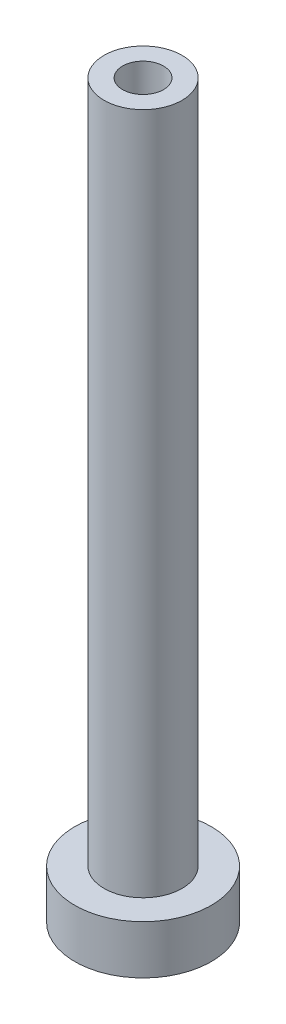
ISO-10303-21;
HEADER;
FILE_DESCRIPTION(('STEP AP214'),'2;1');
FILE_NAME('part.step','',(''),(''),'','','');
FILE_SCHEMA(('AUTOMOTIVE_DESIGN { 1 0 10303 214 1 1 1 1 }'));
ENDSEC;
DATA;
#1=APPLICATION_CONTEXT('core data for automotive mechanical design processes');
#2=APPLICATION_PROTOCOL_DEFINITION('international standard','automotive_design',2000,#1);
#3=PRODUCT_CONTEXT('',#1,'mechanical');
#4=PRODUCT('Part','Part','',(#3));
#5=PRODUCT_RELATED_PRODUCT_CATEGORY('part','',(#4));
#6=PRODUCT_DEFINITION_FORMATION('','',#4);
#7=PRODUCT_DEFINITION_CONTEXT('part definition',#1,'design');
#8=PRODUCT_DEFINITION('design','',#6,#7);
#9=PRODUCT_DEFINITION_SHAPE('','',#8);
#10=(LENGTH_UNIT() NAMED_UNIT(*) SI_UNIT(.MILLI.,.METRE.));
#11=(NAMED_UNIT(*) PLANE_ANGLE_UNIT() SI_UNIT($,.RADIAN.));
#12=(NAMED_UNIT(*) SI_UNIT($,.STERADIAN.) SOLID_ANGLE_UNIT());
#13=UNCERTAINTY_MEASURE_WITH_UNIT(LENGTH_MEASURE(1.E-05),#10,'distance_accuracy_value','');
#14=(GEOMETRIC_REPRESENTATION_CONTEXT(3) GLOBAL_UNCERTAINTY_ASSIGNED_CONTEXT((#13)) GLOBAL_UNIT_ASSIGNED_CONTEXT((#10,
#11,#12)) REPRESENTATION_CONTEXT('',''));
#15=CARTESIAN_POINT('',(0.,0.,0.));
#16=DIRECTION('',(0.,0.,1.));
#17=DIRECTION('',(1.,0.,0.));
#18=AXIS2_PLACEMENT_3D('',#15,#16,#17);
#19=CARTESIAN_POINT('',(0.,0.,0.));
#20=DIRECTION('',(0.,-1.,0.));
#21=DIRECTION('',(0.,0.,-1.));
#22=AXIS2_PLACEMENT_3D('',#19,#20,#21);
#23=CYLINDRICAL_SURFACE('',#22,7.);
#24=CARTESIAN_POINT('',(0.,-5.,0.));
#25=DIRECTION('',(0.,-1.,0.));
#26=DIRECTION('',(0.,0.,-1.));
#27=AXIS2_PLACEMENT_3D('',#24,#25,#26);
#28=CIRCLE('',#27,7.);
#29=CARTESIAN_POINT('',(0.,-5.,-7.));
#30=VERTEX_POINT('',#29);
#31=EDGE_CURVE('E42',#30,#30,#28,.T.);
#32=ORIENTED_EDGE('',*,*,#31,.F.);
#33=EDGE_LOOP('',(#32));
#34=FACE_BOUND('',#33,.T.);
#35=CARTESIAN_POINT('',(0.,0.,0.));
#36=DIRECTION('',(0.,-1.,0.));
#37=DIRECTION('',(0.,0.,-1.));
#38=AXIS2_PLACEMENT_3D('',#35,#36,#37);
#39=CIRCLE('',#38,7.);
#40=CARTESIAN_POINT('',(0.,0.,-7.));
#41=VERTEX_POINT('',#40);
#42=EDGE_CURVE('E9',#41,#41,#39,.T.);
#43=ORIENTED_EDGE('',*,*,#42,.T.);
#44=EDGE_LOOP('',(#43));
#45=FACE_BOUND('',#44,.T.);
#46=ADVANCED_FACE('F14',(#34,#45),#23,.T.);
#47=CARTESIAN_POINT('',(-7.,0.,0.));
#48=DIRECTION('',(0.,-1.,0.));
#49=DIRECTION('',(0.,0.,-1.));
#50=AXIS2_PLACEMENT_3D('',#47,#48,#49);
#51=PLANE('',#50);
#52=ORIENTED_EDGE('',*,*,#42,.F.);
#53=EDGE_LOOP('',(#52));
#54=FACE_BOUND('',#53,.T.);
#55=CARTESIAN_POINT('',(0.,0.,0.));
#56=DIRECTION('',(0.,-1.,0.));
#57=DIRECTION('',(0.,0.,-1.));
#58=AXIS2_PLACEMENT_3D('',#55,#56,#57);
#59=CIRCLE('',#58,4.);
#60=CARTESIAN_POINT('',(0.,0.,-4.));
#61=VERTEX_POINT('',#60);
#62=EDGE_CURVE('E20',#61,#61,#59,.T.);
#63=ORIENTED_EDGE('',*,*,#62,.T.);
#64=EDGE_LOOP('',(#63));
#65=FACE_BOUND('',#64,.T.);
#66=ADVANCED_FACE('F49',(#54,#65),#51,.F.);
#67=CARTESIAN_POINT('',(0.,0.,0.));
#68=DIRECTION('',(0.,-1.,0.));
#69=DIRECTION('',(0.,0.,-1.));
#70=AXIS2_PLACEMENT_3D('',#67,#68,#69);
#71=CYLINDRICAL_SURFACE('',#70,4.);
#72=ORIENTED_EDGE('',*,*,#62,.F.);
#73=EDGE_LOOP('',(#72));
#74=FACE_BOUND('',#73,.T.);
#75=CARTESIAN_POINT('',(0.,70.,0.));
#76=DIRECTION('',(0.,-1.,0.));
#77=DIRECTION('',(0.,0.,-1.));
#78=AXIS2_PLACEMENT_3D('',#75,#76,#77);
#79=CIRCLE('',#78,4.);
#80=CARTESIAN_POINT('',(0.,70.,-4.));
#81=VERTEX_POINT('',#80);
#82=EDGE_CURVE('E24',#81,#81,#79,.T.);
#83=ORIENTED_EDGE('',*,*,#82,.T.);
#84=EDGE_LOOP('',(#83));
#85=FACE_BOUND('',#84,.T.);
#86=ADVANCED_FACE('F55',(#74,#85),#71,.T.);
#87=CARTESIAN_POINT('',(-4.,70.,0.));
#88=DIRECTION('',(0.,-1.,0.));
#89=DIRECTION('',(0.,0.,-1.));
#90=AXIS2_PLACEMENT_3D('',#87,#88,#89);
#91=PLANE('',#90);
#92=ORIENTED_EDGE('',*,*,#82,.F.);
#93=EDGE_LOOP('',(#92));
#94=FACE_BOUND('',#93,.T.);
#95=CARTESIAN_POINT('',(0.,70.,0.));
#96=DIRECTION('',(0.,-1.,0.));
#97=DIRECTION('',(0.,0.,-1.));
#98=AXIS2_PLACEMENT_3D('',#95,#96,#97);
#99=CIRCLE('',#98,2.1);
#100=CARTESIAN_POINT('',(0.,70.,-2.1));
#101=VERTEX_POINT('',#100);
#102=EDGE_CURVE('E28',#101,#101,#99,.T.);
#103=ORIENTED_EDGE('',*,*,#102,.T.);
#104=EDGE_LOOP('',(#103));
#105=FACE_BOUND('',#104,.T.);
#106=ADVANCED_FACE('F61',(#94,#105),#91,.F.);
#107=CARTESIAN_POINT('',(0.,0.,0.));
#108=DIRECTION('',(0.,-1.,0.));
#109=DIRECTION('',(0.,0.,-1.));
#110=AXIS2_PLACEMENT_3D('',#107,#108,#109);
#111=CYLINDRICAL_SURFACE('',#110,2.1);
#112=ORIENTED_EDGE('',*,*,#102,.F.);
#113=EDGE_LOOP('',(#112));
#114=FACE_BOUND('',#113,.T.);
#115=CARTESIAN_POINT('',(0.,25.,0.));
#116=DIRECTION('',(0.,-1.,0.));
#117=DIRECTION('',(0.,0.,-1.));
#118=AXIS2_PLACEMENT_3D('',#115,#116,#117);
#119=CIRCLE('',#118,2.1);
#120=CARTESIAN_POINT('',(0.,25.,-2.1));
#121=VERTEX_POINT('',#120);
#122=EDGE_CURVE('E33',#121,#121,#119,.T.);
#123=ORIENTED_EDGE('',*,*,#122,.T.);
#124=EDGE_LOOP('',(#123));
#125=FACE_BOUND('',#124,.T.);
#126=ADVANCED_FACE('F67',(#114,#125),#111,.F.);
#127=CARTESIAN_POINT('',(0.,24.6,0.));
#128=DIRECTION('',(0.,-1.,0.));
#129=DIRECTION('',(0.,0.,-1.));
#130=AXIS2_PLACEMENT_3D('',#127,#128,#129);
#131=CONICAL_SURFACE('',#130,2.5,0.785398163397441);
#132=ORIENTED_EDGE('',*,*,#122,.F.);
#133=EDGE_LOOP('',(#132));
#134=FACE_BOUND('',#133,.T.);
#135=CARTESIAN_POINT('',(0.,24.6,0.));
#136=DIRECTION('',(0.,-1.,0.));
#137=DIRECTION('',(0.,0.,-1.));
#138=AXIS2_PLACEMENT_3D('',#135,#136,#137);
#139=CIRCLE('',#138,2.5);
#140=CARTESIAN_POINT('',(0.,24.6,-2.5));
#141=VERTEX_POINT('',#140);
#142=EDGE_CURVE('E36',#141,#141,#139,.T.);
#143=ORIENTED_EDGE('',*,*,#142,.T.);
#144=EDGE_LOOP('',(#143));
#145=FACE_BOUND('',#144,.T.);
#146=ADVANCED_FACE('F71',(#134,#145),#131,.F.);
#147=CARTESIAN_POINT('',(0.,0.,0.));
#148=DIRECTION('',(0.,-1.,0.));
#149=DIRECTION('',(0.,0.,-1.));
#150=AXIS2_PLACEMENT_3D('',#147,#148,#149);
#151=CYLINDRICAL_SURFACE('',#150,2.5);
#152=ORIENTED_EDGE('',*,*,#142,.F.);
#153=EDGE_LOOP('',(#152));
#154=FACE_BOUND('',#153,.T.);
#155=CARTESIAN_POINT('',(0.,-5.,0.));
#156=DIRECTION('',(0.,-1.,0.));
#157=DIRECTION('',(0.,0.,-1.));
#158=AXIS2_PLACEMENT_3D('',#155,#156,#157);
#159=CIRCLE('',#158,2.5);
#160=CARTESIAN_POINT('',(0.,-5.,-2.5));
#161=VERTEX_POINT('',#160);
#162=EDGE_CURVE('E39',#161,#161,#159,.T.);
#163=ORIENTED_EDGE('',*,*,#162,.T.);
#164=EDGE_LOOP('',(#163));
#165=FACE_BOUND('',#164,.T.);
#166=ADVANCED_FACE('F75',(#154,#165),#151,.F.);
#167=CARTESIAN_POINT('',(-2.5,-5.,0.));
#168=DIRECTION('',(0.,1.,0.));
#169=DIRECTION('',(0.,0.,1.));
#170=AXIS2_PLACEMENT_3D('',#167,#168,#169);
#171=PLANE('',#170);
#172=ORIENTED_EDGE('',*,*,#162,.F.);
#173=EDGE_LOOP('',(#172));
#174=FACE_BOUND('',#173,.T.);
#175=ORIENTED_EDGE('',*,*,#31,.T.);
#176=EDGE_LOOP('',(#175));
#177=FACE_BOUND('',#176,.T.);
#178=ADVANCED_FACE('F46',(#174,#177),#171,.F.);
#179=CLOSED_SHELL('',(#46,#66,#86,#106,#126,#146,#166,#178));
#180=MANIFOLD_SOLID_BREP('B1',#179);
#181=ADVANCED_BREP_SHAPE_REPRESENTATION('',(#18,#180),#14);
#182=SHAPE_DEFINITION_REPRESENTATION(#9,#181);
ENDSEC;
END-ISO-10303-21;
